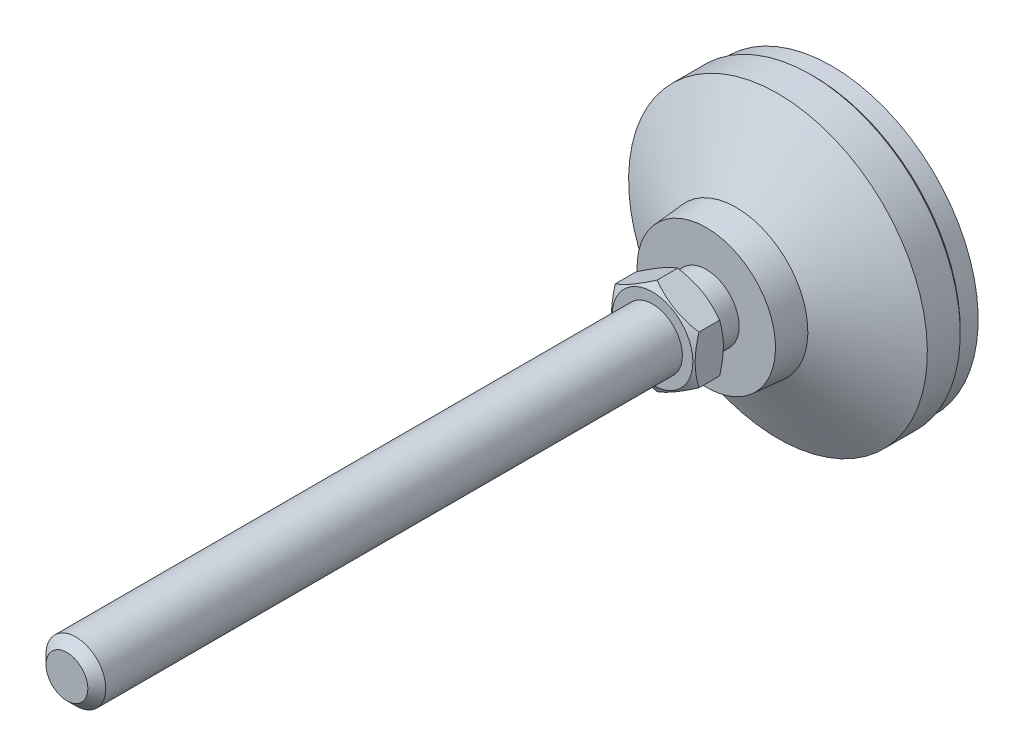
ISO-10303-21;
HEADER;
FILE_DESCRIPTION(('STEP AP214'),'2;1');
FILE_NAME('part.step','',(''),(''),'','','');
FILE_SCHEMA(('AUTOMOTIVE_DESIGN { 1 0 10303 214 1 1 1 1 }'));
ENDSEC;
DATA;
#1=APPLICATION_CONTEXT('core data for automotive mechanical design processes');
#2=APPLICATION_PROTOCOL_DEFINITION('international standard','automotive_design',2000,#1);
#3=PRODUCT_CONTEXT('',#1,'mechanical');
#4=PRODUCT('Part','Part','',(#3));
#5=PRODUCT_RELATED_PRODUCT_CATEGORY('part','',(#4));
#6=PRODUCT_DEFINITION_FORMATION('','',#4);
#7=PRODUCT_DEFINITION_CONTEXT('part definition',#1,'design');
#8=PRODUCT_DEFINITION('design','',#6,#7);
#9=PRODUCT_DEFINITION_SHAPE('','',#8);
#10=(LENGTH_UNIT() NAMED_UNIT(*) SI_UNIT(.MILLI.,.METRE.));
#11=(NAMED_UNIT(*) PLANE_ANGLE_UNIT() SI_UNIT($,.RADIAN.));
#12=(NAMED_UNIT(*) SI_UNIT($,.STERADIAN.) SOLID_ANGLE_UNIT());
#13=UNCERTAINTY_MEASURE_WITH_UNIT(LENGTH_MEASURE(1.E-05),#10,'distance_accuracy_value','');
#14=(GEOMETRIC_REPRESENTATION_CONTEXT(3) GLOBAL_UNCERTAINTY_ASSIGNED_CONTEXT((#13)) GLOBAL_UNIT_ASSIGNED_CONTEXT((#10,
#11,#12)) REPRESENTATION_CONTEXT('',''));
#15=CARTESIAN_POINT('',(0.,0.,0.));
#16=DIRECTION('',(0.,0.,1.));
#17=DIRECTION('',(1.,0.,0.));
#18=AXIS2_PLACEMENT_3D('',#15,#16,#17);
#19=CARTESIAN_POINT('',(0.,0.,2.));
#20=DIRECTION('',(0.,0.,-1.));
#21=DIRECTION('',(0.,1.,0.));
#22=AXIS2_PLACEMENT_3D('',#19,#20,#21);
#23=CYLINDRICAL_SURFACE('',#22,5.50000000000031);
#24=CARTESIAN_POINT('',(0.,0.,25.));
#25=DIRECTION('',(0.,0.,-1.));
#26=DIRECTION('',(0.,1.,0.));
#27=AXIS2_PLACEMENT_3D('',#24,#25,#26);
#28=CIRCLE('',#27,5.50000000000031);
#29=CARTESIAN_POINT('',(0.,5.50000000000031,25.));
#30=VERTEX_POINT('',#29);
#31=EDGE_CURVE('E100',#30,#30,#28,.T.);
#32=ORIENTED_EDGE('',*,*,#31,.T.);
#33=EDGE_LOOP('',(#32));
#34=FACE_BOUND('',#33,.T.);
#35=CARTESIAN_POINT('',(0.,0.,21.));
#36=DIRECTION('',(0.,0.,-1.));
#37=DIRECTION('',(0.,1.,0.));
#38=AXIS2_PLACEMENT_3D('',#35,#36,#37);
#39=CIRCLE('',#38,5.50000000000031);
#40=CARTESIAN_POINT('',(0.,5.50000000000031,21.));
#41=VERTEX_POINT('',#40);
#42=EDGE_CURVE('E93',#41,#41,#39,.T.);
#43=ORIENTED_EDGE('',*,*,#42,.F.);
#44=EDGE_LOOP('',(#43));
#45=FACE_BOUND('',#44,.T.);
#46=ADVANCED_FACE('F14',(#34,#45),#23,.T.);
#47=CARTESIAN_POINT('',(-5.50000000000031,0.,25.));
#48=DIRECTION('',(0.,0.,1.));
#49=DIRECTION('',(0.,-1.,0.));
#50=AXIS2_PLACEMENT_3D('',#47,#48,#49);
#51=PLANE('',#50);
#52=CARTESIAN_POINT('',(0.,0.,25.));
#53=DIRECTION('',(0.,0.,1.));
#54=DIRECTION('',(0.,-1.,0.));
#55=AXIS2_PLACEMENT_3D('',#52,#53,#54);
#56=CIRCLE('',#55,6.75);
#57=CARTESIAN_POINT('',(0.,-6.75,25.));
#58=VERTEX_POINT('',#57);
#59=EDGE_CURVE('E284',#58,#58,#56,.T.);
#60=ORIENTED_EDGE('',*,*,#59,.F.);
#61=EDGE_LOOP('',(#60));
#62=FACE_BOUND('',#61,.T.);
#63=ORIENTED_EDGE('',*,*,#31,.F.);
#64=EDGE_LOOP('',(#63));
#65=FACE_BOUND('',#64,.T.);
#66=ADVANCED_FACE('F142',(#62,#65),#51,.F.);
#67=CARTESIAN_POINT('',(0.,5.50000000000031,21.));
#68=DIRECTION('',(0.,0.,-1.));
#69=DIRECTION('',(0.,1.,0.));
#70=AXIS2_PLACEMENT_3D('',#67,#68,#69);
#71=PLANE('',#70);
#72=ORIENTED_EDGE('',*,*,#42,.T.);
#73=EDGE_LOOP('',(#72));
#74=FACE_BOUND('',#73,.T.);
#75=CARTESIAN_POINT('',(0.,0.,21.));
#76=DIRECTION('',(0.,0.,-1.));
#77=DIRECTION('',(0.,1.,0.));
#78=AXIS2_PLACEMENT_3D('',#75,#76,#77);
#79=CIRCLE('',#78,11.5833333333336);
#80=CARTESIAN_POINT('',(0.,11.5833333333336,21.));
#81=VERTEX_POINT('',#80);
#82=EDGE_CURVE('E88',#81,#81,#79,.T.);
#83=ORIENTED_EDGE('',*,*,#82,.F.);
#84=EDGE_LOOP('',(#83));
#85=FACE_BOUND('',#84,.T.);
#86=ADVANCED_FACE('F125',(#74,#85),#71,.F.);
#87=CARTESIAN_POINT('',(0.,0.,2.));
#88=DIRECTION('',(0.,0.,-1.));
#89=DIRECTION('',(0.,1.,0.));
#90=AXIS2_PLACEMENT_3D('',#87,#88,#89);
#91=CYLINDRICAL_SURFACE('',#90,25.);
#92=CARTESIAN_POINT('',(0.,0.,3.5));
#93=DIRECTION('',(0.,0.,1.));
#94=DIRECTION('',(0.,-1.,0.));
#95=AXIS2_PLACEMENT_3D('',#92,#93,#94);
#96=CIRCLE('',#95,25.);
#97=CARTESIAN_POINT('',(0.,-25.,3.5));
#98=VERTEX_POINT('',#97);
#99=EDGE_CURVE('E108',#98,#98,#96,.T.);
#100=ORIENTED_EDGE('',*,*,#99,.T.);
#101=EDGE_LOOP('',(#100));
#102=FACE_BOUND('',#101,.T.);
#103=CARTESIAN_POINT('',(0.,0.,9.));
#104=DIRECTION('',(0.,0.,-1.));
#105=DIRECTION('',(0.,1.,0.));
#106=AXIS2_PLACEMENT_3D('',#103,#104,#105);
#107=CIRCLE('',#106,25.);
#108=CARTESIAN_POINT('',(0.,25.,9.));
#109=VERTEX_POINT('',#108);
#110=EDGE_CURVE('E106',#109,#109,#107,.T.);
#111=ORIENTED_EDGE('',*,*,#110,.T.);
#112=EDGE_LOOP('',(#111));
#113=FACE_BOUND('',#112,.T.);
#114=ADVANCED_FACE('F121',(#102,#113),#91,.T.);
#115=CARTESIAN_POINT('',(0.,0.,16.));
#116=DIRECTION('',(0.,0.,-1.));
#117=DIRECTION('',(0.,1.,0.));
#118=AXIS2_PLACEMENT_3D('',#115,#116,#117);
#119=CONICAL_SURFACE('',#118,12.0000000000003,1.07685495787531);
#120=ORIENTED_EDGE('',*,*,#110,.F.);
#121=EDGE_LOOP('',(#120));
#122=FACE_BOUND('',#121,.T.);
#123=CARTESIAN_POINT('',(0.,0.,16.));
#124=DIRECTION('',(0.,0.,-1.));
#125=DIRECTION('',(0.,1.,0.));
#126=AXIS2_PLACEMENT_3D('',#123,#124,#125);
#127=CIRCLE('',#126,12.0000000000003);
#128=CARTESIAN_POINT('',(0.,12.0000000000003,16.));
#129=VERTEX_POINT('',#128);
#130=EDGE_CURVE('E103',#129,#129,#127,.T.);
#131=ORIENTED_EDGE('',*,*,#130,.T.);
#132=EDGE_LOOP('',(#131));
#133=FACE_BOUND('',#132,.T.);
#134=ADVANCED_FACE('F124',(#122,#133),#119,.T.);
#135=CARTESIAN_POINT('',(0.,0.,22.));
#136=DIRECTION('',(0.,0.,-1.));
#137=DIRECTION('',(0.,1.,0.));
#138=AXIS2_PLACEMENT_3D('',#135,#136,#137);
#139=CONICAL_SURFACE('',#138,11.5000000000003,0.0831412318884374);
#140=ORIENTED_EDGE('',*,*,#82,.T.);
#141=EDGE_LOOP('',(#140));
#142=FACE_BOUND('',#141,.T.);
#143=ORIENTED_EDGE('',*,*,#130,.F.);
#144=EDGE_LOOP('',(#143));
#145=FACE_BOUND('',#144,.T.);
#146=ADVANCED_FACE('F118',(#142,#145),#139,.T.);
#147=CARTESIAN_POINT('',(0.,0.,3.5));
#148=DIRECTION('',(0.,0.,1.));
#149=DIRECTION('',(0.,-1.,0.));
#150=AXIS2_PLACEMENT_3D('',#147,#148,#149);
#151=CONICAL_SURFACE('',#150,25.,0.785398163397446);
#152=CARTESIAN_POINT('',(0.,0.,3.));
#153=DIRECTION('',(0.,0.,1.));
#154=DIRECTION('',(0.,-1.,0.));
#155=AXIS2_PLACEMENT_3D('',#152,#153,#154);
#156=CIRCLE('',#155,24.5);
#157=CARTESIAN_POINT('',(0.,-24.5,3.));
#158=VERTEX_POINT('',#157);
#159=EDGE_CURVE('E28',#158,#158,#156,.F.);
#160=ORIENTED_EDGE('',*,*,#159,.F.);
#161=EDGE_LOOP('',(#160));
#162=FACE_BOUND('',#161,.T.);
#163=ORIENTED_EDGE('',*,*,#99,.F.);
#164=EDGE_LOOP('',(#163));
#165=FACE_BOUND('',#164,.T.);
#166=ADVANCED_FACE('F16',(#162,#165),#151,.T.);
#167=CARTESIAN_POINT('',(0.,0.,0.));
#168=DIRECTION('',(0.,0.,1.));
#169=DIRECTION('',(0.,-1.,0.));
#170=AXIS2_PLACEMENT_3D('',#167,#168,#169);
#171=CYLINDRICAL_SURFACE('',#170,24.5);
#172=CARTESIAN_POINT('',(0.,0.,0.));
#173=DIRECTION('',(0.,0.,-1.));
#174=DIRECTION('',(0.,1.,0.));
#175=AXIS2_PLACEMENT_3D('',#172,#173,#174);
#176=CIRCLE('',#175,24.5);
#177=CARTESIAN_POINT('',(0.,24.5,0.));
#178=VERTEX_POINT('',#177);
#179=EDGE_CURVE('E251',#178,#178,#176,.T.);
#180=ORIENTED_EDGE('',*,*,#179,.F.);
#181=EDGE_LOOP('',(#180));
#182=FACE_BOUND('',#181,.T.);
#183=ORIENTED_EDGE('',*,*,#159,.T.);
#184=EDGE_LOOP('',(#183));
#185=FACE_BOUND('',#184,.T.);
#186=ADVANCED_FACE('F114',(#182,#185),#171,.T.);
#187=CARTESIAN_POINT('',(0.,0.,0.));
#188=DIRECTION('',(0.,0.,-1.));
#189=DIRECTION('',(0.,1.,0.));
#190=AXIS2_PLACEMENT_3D('',#187,#188,#189);
#191=PLANE('',#190);
#192=ORIENTED_EDGE('',*,*,#179,.T.);
#193=EDGE_LOOP('',(#192));
#194=FACE_BOUND('',#193,.T.);
#195=ADVANCED_FACE('F193',(#194),#191,.T.);
#196=CARTESIAN_POINT('',(0.,0.,25.));
#197=DIRECTION('',(0.,0.,1.));
#198=DIRECTION('',(0.,-1.,0.));
#199=AXIS2_PLACEMENT_3D('',#196,#197,#198);
#200=CONICAL_SURFACE('',#199,6.75,1.0471975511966);
#201=CARTESIAN_POINT('',(0.000200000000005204,-8.08301923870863,25.7696190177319));
#202=CARTESIAN_POINT('',(-0.153667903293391,-7.99418356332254,25.7183374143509));
#203=CARTESIAN_POINT('',(-0.308109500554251,-7.90501666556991,25.669383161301));
#204=CARTESIAN_POINT('',(-0.618246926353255,-7.72595873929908,25.5767703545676));
#205=CARTESIAN_POINT('',(-0.773943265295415,-7.63606741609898,25.5331140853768));
#206=CARTESIAN_POINT('',(-1.24352516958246,-7.36495417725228,25.4109491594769));
#207=CARTESIAN_POINT('',(-1.5592643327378,-7.18266208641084,25.3414631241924));
#208=CARTESIAN_POINT('',(-2.03176224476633,-6.90986528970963,25.2599825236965));
#209=CARTESIAN_POINT('',(-2.18710922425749,-6.82017566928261,25.2367710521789));
#210=CARTESIAN_POINT('',(-2.49850511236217,-6.64039116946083,25.1978487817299));
#211=CARTESIAN_POINT('',(-2.65455395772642,-6.55029632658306,25.1821373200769));
#212=CARTESIAN_POINT('',(-2.96692267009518,-6.36995016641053,25.1586154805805));
#213=CARTESIAN_POINT('',(-3.12324202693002,-6.27969914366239,25.1507961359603));
#214=CARTESIAN_POINT('',(-3.43601650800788,-6.09911871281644,25.1432178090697));
#215=CARTESIAN_POINT('',(-3.59247162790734,-6.00878930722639,25.1434585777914));
#216=CARTESIAN_POINT('',(-4.02110687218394,-5.76131663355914,25.155197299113));
#217=CARTESIAN_POINT('',(-4.2931466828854,-5.60425437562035,25.1749033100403));
#218=CARTESIAN_POINT('',(-4.8354194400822,-5.29117305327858,25.2373910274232));
#219=CARTESIAN_POINT('',(-5.10565047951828,-5.13515508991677,25.2801940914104));
#220=CARTESIAN_POINT('',(-5.64901454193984,-4.82144370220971,25.3871892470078));
#221=CARTESIAN_POINT('',(-5.92207900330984,-4.66378986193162,25.4518346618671));
#222=CARTESIAN_POINT('',(-6.46413578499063,-4.35083323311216,25.5985536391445));
#223=CARTESIAN_POINT('',(-6.73313504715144,-4.1955264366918,25.680592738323));
#224=CARTESIAN_POINT('',(-7.0002,-4.04133641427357,25.7696190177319));
#225=B_SPLINE_CURVE_WITH_KNOTS('',3,(#201,#202,#203,#204,#205,#206,#207,#208,#209,#210,#211,
#212,#213,#214,#215,#216,#217,#218,#219,#220,#221,#222,#223,#224),.UNSPECIFIED.,.F.,.F.,(4,2,2,
2,2,2,2,2,2,2,2,4),(0.,0.554727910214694,1.10969417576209,2.2219327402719,2.76443041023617,
3.30688013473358,3.84871284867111,4.3905288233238,5.33376515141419,6.27787517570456,
7.2429241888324,8.20607866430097),.UNSPECIFIED.);
#226=CARTESIAN_POINT('',(0.,-8.08290376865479,25.7695523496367));
#227=VERTEX_POINT('',#226);
#228=CARTESIAN_POINT('',(-7.,-4.04145188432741,25.7695523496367));
#229=VERTEX_POINT('',#228);
#230=EDGE_CURVE('E73',#227,#229,#225,.T.);
#231=ORIENTED_EDGE('',*,*,#230,.T.);
#232=CARTESIAN_POINT('',(-7.,10.881878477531,28.5731663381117));
#233=CARTESIAN_POINT('',(-7.,10.5759223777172,28.4246456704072));
#234=CARTESIAN_POINT('',(-7.,10.2692667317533,28.2775415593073));
#235=CARTESIAN_POINT('',(-7.,9.65418441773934,27.9869626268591));
#236=CARTESIAN_POINT('',(-7.,9.34575748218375,27.8434883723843));
#237=CARTESIAN_POINT('',(-7.,8.72518404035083,27.5602490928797));
#238=CARTESIAN_POINT('',(-7.,8.41302644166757,27.4205082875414));
#239=CARTESIAN_POINT('',(-7.,7.78623760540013,27.1467106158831));
#240=CARTESIAN_POINT('',(-7.,7.47160648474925,27.0126534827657));
#241=CARTESIAN_POINT('',(-7.,6.82911545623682,26.7474907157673));
#242=CARTESIAN_POINT('',(-7.,6.50115736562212,26.6166216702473));
#243=CARTESIAN_POINT('',(-7.,5.84141472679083,26.3647252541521));
#244=CARTESIAN_POINT('',(-7.,5.50962975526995,26.2436989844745));
#245=CARTESIAN_POINT('',(-7.,4.84231409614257,26.0146465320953));
#246=CARTESIAN_POINT('',(-7.,4.50679246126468,25.9065942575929));
#247=CARTESIAN_POINT('',(-7.,3.83094824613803,25.7069384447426));
#248=CARTESIAN_POINT('',(-7.,3.4906272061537,25.6153297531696));
#249=CARTESIAN_POINT('',(-7.,2.8068282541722,25.4534347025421));
#250=CARTESIAN_POINT('',(-7.,2.46337870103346,25.3830317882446));
#251=CARTESIAN_POINT('',(-7.,1.94505562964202,25.296366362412));
#252=CARTESIAN_POINT('',(-7.,1.77174375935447,25.270633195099));
#253=CARTESIAN_POINT('',(-7.,1.4242505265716,25.2259841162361));
#254=CARTESIAN_POINT('',(-7.,1.25006925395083,25.2070675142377));
#255=CARTESIAN_POINT('',(-7.,0.903356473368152,25.176666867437));
#256=CARTESIAN_POINT('',(-7.,0.730833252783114,25.165088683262));
#257=CARTESIAN_POINT('',(-7.,0.385451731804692,25.149239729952));
#258=CARTESIAN_POINT('',(-7.,0.212593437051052,25.1449688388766));
#259=CARTESIAN_POINT('',(-7.,-0.133149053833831,25.1438364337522));
#260=CARTESIAN_POINT('',(-7.,-0.306033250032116,25.1469749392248));
#261=CARTESIAN_POINT('',(-7.,-0.651514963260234,25.1605842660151));
#262=CARTESIAN_POINT('',(-7.,-0.824112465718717,25.1710554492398));
#263=CARTESIAN_POINT('',(-7.,-1.23812388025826,25.2047451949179));
#264=CARTESIAN_POINT('',(-7.,-1.47926423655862,25.2313988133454));
#265=CARTESIAN_POINT('',(-7.,-1.95976100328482,25.2975709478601));
#266=CARTESIAN_POINT('',(-7.,-2.1991171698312,25.3370911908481));
#267=CARTESIAN_POINT('',(-7.,-2.91423225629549,25.4728568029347));
#268=CARTESIAN_POINT('',(-7.,-3.38677291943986,25.586282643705));
#269=CARTESIAN_POINT('',(-7.,-4.09338777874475,25.7830543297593));
#270=CARTESIAN_POINT('',(-7.,-4.33112485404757,25.8540038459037));
#271=CARTESIAN_POINT('',(-7.,-4.80429012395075,26.0032925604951));
#272=CARTESIAN_POINT('',(-7.,-5.0397183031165,26.0816318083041));
#273=CARTESIAN_POINT('',(-7.,-5.50833948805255,26.244441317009));
#274=CARTESIAN_POINT('',(-7.,-5.74153319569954,26.3289095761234));
#275=CARTESIAN_POINT('',(-7.,-6.20598704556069,26.5029811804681));
#276=CARTESIAN_POINT('',(-7.,-6.43724721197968,26.5925844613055));
#277=CARTESIAN_POINT('',(-7.,-6.98916133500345,26.8123542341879));
#278=CARTESIAN_POINT('',(-7.,-7.30900559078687,26.9445505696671));
#279=CARTESIAN_POINT('',(-7.,-7.94592265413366,27.2154785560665));
#280=CARTESIAN_POINT('',(-7.,-8.26299528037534,27.354210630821));
#281=CARTESIAN_POINT('',(-7.,-8.89488830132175,27.6368774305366));
#282=CARTESIAN_POINT('',(-7.,-9.20970819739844,27.7808132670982));
#283=CARTESIAN_POINT('',(-7.,-9.83742326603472,28.0728299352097));
#284=CARTESIAN_POINT('',(-7.,-10.150318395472,28.2209108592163));
#285=CARTESIAN_POINT('',(-7.,-10.7748456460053,28.5205922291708));
#286=CARTESIAN_POINT('',(-7.,-11.0864759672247,28.6721964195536));
#287=CARTESIAN_POINT('',(-7.,-11.7083826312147,28.9781595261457));
#288=CARTESIAN_POINT('',(-7.,-12.0186589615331,29.1325184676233));
#289=CARTESIAN_POINT('',(-7.,-12.9476977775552,29.5989412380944));
#290=CARTESIAN_POINT('',(-7.,-13.5647586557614,29.9143938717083));
#291=CARTESIAN_POINT('',(-7.,-14.7428047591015,30.5242920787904));
#292=CARTESIAN_POINT('',(-7.,-15.3040599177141,30.8182186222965));
#293=CARTESIAN_POINT('',(-7.,-16.4244943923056,31.4100497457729));
#294=CARTESIAN_POINT('',(-7.,-16.9836736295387,31.7079544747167));
#295=CARTESIAN_POINT('',(-7.,-18.0989732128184,32.3060119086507));
#296=CARTESIAN_POINT('',(-7.,-18.6550977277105,32.606156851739));
#297=CARTESIAN_POINT('',(-7.,-19.7660233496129,33.2088114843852));
#298=CARTESIAN_POINT('',(-7.,-20.3208245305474,33.5113210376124));
#299=CARTESIAN_POINT('',(-7.,-20.8751406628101,33.8147108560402));
#300=B_SPLINE_CURVE_WITH_KNOTS('',3,(#232,#233,#234,#235,#236,#237,#238,#239,#240,#241,#242,
#243,#244,#245,#246,#247,#248,#249,#250,#251,#252,#253,#254,#255,#256,#257,#258,#259,#260,#261,
#262,#263,#264,#265,#266,#267,#268,#269,#270,#271,#272,#273,#274,#275,#276,#277,#278,#279,#280,
#281,#282,#283,#284,#285,#286,#287,#288,#289,#290,#291,#292,#293,#294,#295,#296,#297,#298,#299),
.UNSPECIFIED.,.F.,.F.,(4,2,2,2,2,2,2,2,2,2,2,2,2,2,2,2,2,2,2,2,2,2,2,2,2,2,2,2,2,2,2,2,2,4),(0.,
1.02031018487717,2.04077873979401,3.06675901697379,4.09269108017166,5.15188378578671,
6.21119479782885,7.26833843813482,8.32515020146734,9.3760426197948,9.90156529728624,
10.4270347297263,10.9456190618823,11.4641947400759,11.9827717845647,12.5013744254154,
13.2287906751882,13.9563045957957,15.4121267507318,16.1563590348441,16.9005962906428,
17.6445915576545,18.3885774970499,19.4267396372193,20.4649691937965,21.5034218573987,
22.5418977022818,23.5815328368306,24.6211775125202,26.7001717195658,28.6008392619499,
30.5015781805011,32.3974236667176,34.2931606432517),.UNSPECIFIED.);
#301=CARTESIAN_POINT('',(-7.,4.04145188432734,25.7695523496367));
#302=VERTEX_POINT('',#301);
#303=EDGE_CURVE('E81',#229,#302,#300,.F.);
#304=ORIENTED_EDGE('',*,*,#303,.T.);
#305=CARTESIAN_POINT('',(-7.0002,4.0413364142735,25.7696190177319));
#306=CARTESIAN_POINT('',(-6.84633209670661,4.13017208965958,25.7183374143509));
#307=CARTESIAN_POINT('',(-6.69189049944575,4.21933898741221,25.669383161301));
#308=CARTESIAN_POINT('',(-6.38175307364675,4.39839691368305,25.5767703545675));
#309=CARTESIAN_POINT('',(-6.22605673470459,4.48828823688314,25.5331140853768));
#310=CARTESIAN_POINT('',(-5.75647483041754,4.75940147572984,25.4109491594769));
#311=CARTESIAN_POINT('',(-5.44073566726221,4.94169356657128,25.3414631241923));
#312=CARTESIAN_POINT('',(-4.96823775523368,5.21449036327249,25.2599825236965));
#313=CARTESIAN_POINT('',(-4.81289077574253,5.3041799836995,25.2367710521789));
#314=CARTESIAN_POINT('',(-4.50149488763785,5.48396448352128,25.1978487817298));
#315=CARTESIAN_POINT('',(-4.34544604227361,5.57405932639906,25.1821373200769));
#316=CARTESIAN_POINT('',(-4.03307732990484,5.75440548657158,25.1586154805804));
#317=CARTESIAN_POINT('',(-3.87675797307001,5.84465650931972,25.1507961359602));
#318=CARTESIAN_POINT('',(-3.56398349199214,6.02523694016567,25.1432178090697));
#319=CARTESIAN_POINT('',(-3.40752837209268,6.11556634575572,25.1434585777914));
#320=CARTESIAN_POINT('',(-2.97889312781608,6.36303901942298,25.155197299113));
#321=CARTESIAN_POINT('',(-2.70685331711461,6.52010127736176,25.1749033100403));
#322=CARTESIAN_POINT('',(-2.16458055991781,6.83318259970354,25.2373910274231));
#323=CARTESIAN_POINT('',(-1.89434952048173,6.98920056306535,25.2801940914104));
#324=CARTESIAN_POINT('',(-1.35098545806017,7.30291195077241,25.3871892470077));
#325=CARTESIAN_POINT('',(-1.07792099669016,7.4605657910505,25.4518346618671));
#326=CARTESIAN_POINT('',(-0.535864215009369,7.77352241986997,25.5985536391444));
#327=CARTESIAN_POINT('',(-0.266864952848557,7.92882921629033,25.680592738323));
#328=CARTESIAN_POINT('',(0.000200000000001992,8.08301923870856,25.7696190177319));
#329=B_SPLINE_CURVE_WITH_KNOTS('',3,(#305,#306,#307,#308,#309,#310,#311,#312,#313,#314,#315,
#316,#317,#318,#319,#320,#321,#322,#323,#324,#325,#326,#327,#328),.UNSPECIFIED.,.F.,.F.,(4,2,2,
2,2,2,2,2,2,2,2,4),(0.,0.554727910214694,1.10969417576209,2.22193274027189,2.76443041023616,
3.30688013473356,3.84871284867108,4.39052882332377,5.33376515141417,6.27787517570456,
7.2429241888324,8.20607866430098),.UNSPECIFIED.);
#330=CARTESIAN_POINT('',(0.,8.08290376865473,25.7695523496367));
#331=VERTEX_POINT('',#330);
#332=EDGE_CURVE('E214',#302,#331,#329,.T.);
#333=ORIENTED_EDGE('',*,*,#332,.T.);
#334=CARTESIAN_POINT('',(-0.000199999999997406,8.08301923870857,25.7696190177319));
#335=CARTESIAN_POINT('',(0.153667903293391,7.99418356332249,25.7183374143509));
#336=CARTESIAN_POINT('',(0.308109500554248,7.90501666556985,25.669383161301));
#337=CARTESIAN_POINT('',(0.61824692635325,7.72595873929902,25.5767703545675));
#338=CARTESIAN_POINT('',(0.77394326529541,7.63606741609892,25.5331140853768));
#339=CARTESIAN_POINT('',(1.24352516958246,7.36495417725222,25.4109491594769));
#340=CARTESIAN_POINT('',(1.55926433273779,7.18266208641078,25.3414631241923));
#341=CARTESIAN_POINT('',(2.03176224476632,6.90986528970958,25.2599825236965));
#342=CARTESIAN_POINT('',(2.18710922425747,6.82017566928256,25.2367710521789));
#343=CARTESIAN_POINT('',(2.49850511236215,6.64039116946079,25.1978487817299));
#344=CARTESIAN_POINT('',(2.65455395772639,6.55029632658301,25.1821373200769));
#345=CARTESIAN_POINT('',(2.96692267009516,6.36995016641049,25.1586154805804));
#346=CARTESIAN_POINT('',(3.12324202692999,6.27969914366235,25.1507961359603));
#347=CARTESIAN_POINT('',(3.43601650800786,6.0991187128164,25.1432178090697));
#348=CARTESIAN_POINT('',(3.59247162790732,6.00878930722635,25.1434585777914));
#349=CARTESIAN_POINT('',(4.02110687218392,5.76131663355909,25.155197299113));
#350=CARTESIAN_POINT('',(4.29314668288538,5.60425437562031,25.1749033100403));
#351=CARTESIAN_POINT('',(4.83541944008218,5.29117305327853,25.2373910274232));
#352=CARTESIAN_POINT('',(5.10565047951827,5.13515508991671,25.2801940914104));
#353=CARTESIAN_POINT('',(5.64901454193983,4.82144370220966,25.3871892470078));
#354=CARTESIAN_POINT('',(5.92207900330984,4.66378986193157,25.4518346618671));
#355=CARTESIAN_POINT('',(6.46413578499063,4.3508332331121,25.5985536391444));
#356=CARTESIAN_POINT('',(6.73313504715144,4.19552643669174,25.680592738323));
#357=CARTESIAN_POINT('',(7.0002,4.04133641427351,25.7696190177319));
#358=B_SPLINE_CURVE_WITH_KNOTS('',3,(#334,#335,#336,#337,#338,#339,#340,#341,#342,#343,#344,
#345,#346,#347,#348,#349,#350,#351,#352,#353,#354,#355,#356,#357),.UNSPECIFIED.,.F.,.F.,(4,2,2,
2,2,2,2,2,2,2,2,4),(0.,0.554727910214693,1.10969417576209,2.22193274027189,2.76443041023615,
3.30688013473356,3.84871284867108,4.39052882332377,5.33376515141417,6.27787517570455,
7.2429241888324,8.20607866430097),.UNSPECIFIED.);
#359=CARTESIAN_POINT('',(7.,4.04145188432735,25.7695523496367));
#360=VERTEX_POINT('',#359);
#361=EDGE_CURVE('E208',#331,#360,#358,.T.);
#362=ORIENTED_EDGE('',*,*,#361,.T.);
#363=CARTESIAN_POINT('',(7.,10.881878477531,28.5731663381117));
#364=CARTESIAN_POINT('',(7.,10.5759223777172,28.4246456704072));
#365=CARTESIAN_POINT('',(7.,10.2692667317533,28.2775415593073));
#366=CARTESIAN_POINT('',(7.,9.65418441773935,27.9869626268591));
#367=CARTESIAN_POINT('',(7.,9.34575748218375,27.8434883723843));
#368=CARTESIAN_POINT('',(7.,8.72518404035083,27.5602490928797));
#369=CARTESIAN_POINT('',(7.,8.41302644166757,27.4205082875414));
#370=CARTESIAN_POINT('',(7.,7.78623760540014,27.1467106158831));
#371=CARTESIAN_POINT('',(7.,7.47160648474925,27.0126534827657));
#372=CARTESIAN_POINT('',(7.,6.82911545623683,26.7474907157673));
#373=CARTESIAN_POINT('',(7.,6.50115736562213,26.6166216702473));
#374=CARTESIAN_POINT('',(7.,5.84141472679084,26.3647252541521));
#375=CARTESIAN_POINT('',(7.,5.50962975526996,26.2436989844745));
#376=CARTESIAN_POINT('',(7.,4.84231409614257,26.0146465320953));
#377=CARTESIAN_POINT('',(7.,4.50679246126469,25.9065942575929));
#378=CARTESIAN_POINT('',(7.,3.83094824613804,25.7069384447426));
#379=CARTESIAN_POINT('',(7.,3.49062720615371,25.6153297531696));
#380=CARTESIAN_POINT('',(7.,2.80682825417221,25.4534347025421));
#381=CARTESIAN_POINT('',(7.,2.46337870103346,25.3830317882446));
#382=CARTESIAN_POINT('',(7.,1.94505562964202,25.296366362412));
#383=CARTESIAN_POINT('',(7.,1.77174375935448,25.270633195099));
#384=CARTESIAN_POINT('',(7.,1.4242505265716,25.2259841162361));
#385=CARTESIAN_POINT('',(7.,1.25006925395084,25.2070675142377));
#386=CARTESIAN_POINT('',(7.,0.903356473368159,25.176666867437));
#387=CARTESIAN_POINT('',(7.,0.730833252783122,25.165088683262));
#388=CARTESIAN_POINT('',(7.,0.3854517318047,25.149239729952));
#389=CARTESIAN_POINT('',(7.,0.21259343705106,25.1449688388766));
#390=CARTESIAN_POINT('',(7.,-0.133149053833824,25.1438364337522));
#391=CARTESIAN_POINT('',(7.,-0.30603325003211,25.1469749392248));
#392=CARTESIAN_POINT('',(7.,-0.651514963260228,25.1605842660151));
#393=CARTESIAN_POINT('',(7.,-0.824112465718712,25.1710554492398));
#394=CARTESIAN_POINT('',(7.,-1.23812388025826,25.2047451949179));
#395=CARTESIAN_POINT('',(7.,-1.47926423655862,25.2313988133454));
#396=CARTESIAN_POINT('',(7.,-1.95976100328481,25.2975709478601));
#397=CARTESIAN_POINT('',(7.,-2.19911716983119,25.3370911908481));
#398=CARTESIAN_POINT('',(7.,-2.91423225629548,25.4728568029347));
#399=CARTESIAN_POINT('',(7.,-3.38677291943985,25.586282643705));
#400=CARTESIAN_POINT('',(7.,-4.09338777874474,25.7830543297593));
#401=CARTESIAN_POINT('',(7.,-4.33112485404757,25.8540038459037));
#402=CARTESIAN_POINT('',(7.,-4.80429012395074,26.0032925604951));
#403=CARTESIAN_POINT('',(7.,-5.03971830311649,26.0816318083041));
#404=CARTESIAN_POINT('',(7.,-5.50833948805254,26.244441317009));
#405=CARTESIAN_POINT('',(7.,-5.74153319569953,26.3289095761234));
#406=CARTESIAN_POINT('',(7.,-6.20598704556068,26.5029811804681));
#407=CARTESIAN_POINT('',(7.,-6.43724721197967,26.5925844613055));
#408=CARTESIAN_POINT('',(7.,-6.98916133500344,26.8123542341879));
#409=CARTESIAN_POINT('',(7.,-7.30900559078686,26.9445505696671));
#410=CARTESIAN_POINT('',(7.,-7.94592265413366,27.2154785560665));
#411=CARTESIAN_POINT('',(7.,-8.26299528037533,27.354210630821));
#412=CARTESIAN_POINT('',(7.,-8.89488830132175,27.6368774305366));
#413=CARTESIAN_POINT('',(7.,-9.20970819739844,27.7808132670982));
#414=CARTESIAN_POINT('',(7.,-9.83742326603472,28.0728299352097));
#415=CARTESIAN_POINT('',(7.,-10.150318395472,28.2209108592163));
#416=CARTESIAN_POINT('',(7.,-10.7748456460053,28.5205922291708));
#417=CARTESIAN_POINT('',(7.,-11.0864759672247,28.6721964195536));
#418=CARTESIAN_POINT('',(7.,-11.7083826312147,28.9781595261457));
#419=CARTESIAN_POINT('',(7.,-12.0186589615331,29.1325184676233));
#420=CARTESIAN_POINT('',(7.,-12.9476977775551,29.5989412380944));
#421=CARTESIAN_POINT('',(7.,-13.5647586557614,29.9143938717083));
#422=CARTESIAN_POINT('',(7.,-14.7428047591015,30.5242920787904));
#423=CARTESIAN_POINT('',(7.,-15.3040599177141,30.8182186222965));
#424=CARTESIAN_POINT('',(7.,-16.4244943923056,31.4100497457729));
#425=CARTESIAN_POINT('',(7.,-16.9836736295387,31.7079544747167));
#426=CARTESIAN_POINT('',(7.,-18.0989732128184,32.3060119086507));
#427=CARTESIAN_POINT('',(7.,-18.6550977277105,32.606156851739));
#428=CARTESIAN_POINT('',(7.,-19.7660233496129,33.2088114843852));
#429=CARTESIAN_POINT('',(7.,-20.3208245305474,33.5113210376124));
#430=CARTESIAN_POINT('',(7.,-20.8751406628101,33.8147108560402));
#431=B_SPLINE_CURVE_WITH_KNOTS('',3,(#363,#364,#365,#366,#367,#368,#369,#370,#371,#372,#373,
#374,#375,#376,#377,#378,#379,#380,#381,#382,#383,#384,#385,#386,#387,#388,#389,#390,#391,#392,
#393,#394,#395,#396,#397,#398,#399,#400,#401,#402,#403,#404,#405,#406,#407,#408,#409,#410,#411,
#412,#413,#414,#415,#416,#417,#418,#419,#420,#421,#422,#423,#424,#425,#426,#427,#428,#429,#430),
.UNSPECIFIED.,.F.,.F.,(4,2,2,2,2,2,2,2,2,2,2,2,2,2,2,2,2,2,2,2,2,2,2,2,2,2,2,2,2,2,2,2,2,4),(0.,
1.02031018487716,2.04077873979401,3.06675901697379,4.09269108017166,5.1518837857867,
6.21119479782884,7.26833843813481,8.32515020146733,9.3760426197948,9.90156529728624,
10.4270347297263,10.9456190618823,11.4641947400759,11.9827717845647,12.5013744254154,
13.2287906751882,13.9563045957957,15.4121267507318,16.1563590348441,16.9005962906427,
17.6445915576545,18.3885774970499,19.4267396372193,20.4649691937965,21.5034218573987,
22.5418977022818,23.5815328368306,24.6211775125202,26.7001717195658,28.6008392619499,
30.5015781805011,32.3974236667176,34.2931606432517),.UNSPECIFIED.);
#432=CARTESIAN_POINT('',(7.,-4.04145188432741,25.7695523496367));
#433=VERTEX_POINT('',#432);
#434=EDGE_CURVE('E34',#360,#433,#431,.T.);
#435=ORIENTED_EDGE('',*,*,#434,.T.);
#436=CARTESIAN_POINT('',(7.0002,-4.04133641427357,25.7696190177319));
#437=CARTESIAN_POINT('',(6.84633209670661,-4.13017208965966,25.7183374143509));
#438=CARTESIAN_POINT('',(6.69189049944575,-4.21933898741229,25.669383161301));
#439=CARTESIAN_POINT('',(6.38175307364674,-4.39839691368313,25.5767703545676));
#440=CARTESIAN_POINT('',(6.22605673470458,-4.48828823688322,25.5331140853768));
#441=CARTESIAN_POINT('',(5.75647483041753,-4.75940147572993,25.4109491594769));
#442=CARTESIAN_POINT('',(5.4407356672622,-4.94169356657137,25.3414631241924));
#443=CARTESIAN_POINT('',(4.96823775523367,-5.21449036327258,25.2599825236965));
#444=CARTESIAN_POINT('',(4.81289077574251,-5.30417998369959,25.2367710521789));
#445=CARTESIAN_POINT('',(4.50149488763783,-5.48396448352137,25.1978487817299));
#446=CARTESIAN_POINT('',(4.34544604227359,-5.57405932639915,25.182137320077));
#447=CARTESIAN_POINT('',(4.03307732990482,-5.75440548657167,25.1586154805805));
#448=CARTESIAN_POINT('',(3.87675797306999,-5.84465650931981,25.1507961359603));
#449=CARTESIAN_POINT('',(3.56398349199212,-6.02523694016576,25.1432178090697));
#450=CARTESIAN_POINT('',(3.40752837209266,-6.11556634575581,25.1434585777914));
#451=CARTESIAN_POINT('',(2.97889312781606,-6.36303901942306,25.155197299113));
#452=CARTESIAN_POINT('',(2.7068533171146,-6.52010127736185,25.1749033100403));
#453=CARTESIAN_POINT('',(2.16458055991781,-6.83318259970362,25.2373910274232));
#454=CARTESIAN_POINT('',(1.89434952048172,-6.98920056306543,25.2801940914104));
#455=CARTESIAN_POINT('',(1.35098545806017,-7.30291195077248,25.3871892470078));
#456=CARTESIAN_POINT('',(1.07792099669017,-7.46056579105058,25.4518346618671));
#457=CARTESIAN_POINT('',(0.535864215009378,-7.77352241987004,25.5985536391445));
#458=CARTESIAN_POINT('',(0.266864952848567,-7.9288292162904,25.680592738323));
#459=CARTESIAN_POINT('',(-0.000199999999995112,-8.08301923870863,25.7696190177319));
#460=B_SPLINE_CURVE_WITH_KNOTS('',3,(#436,#437,#438,#439,#440,#441,#442,#443,#444,#445,#446,
#447,#448,#449,#450,#451,#452,#453,#454,#455,#456,#457,#458,#459),.UNSPECIFIED.,.F.,.F.,(4,2,2,
2,2,2,2,2,2,2,2,4),(0.,0.554727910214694,1.10969417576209,2.2219327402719,2.76443041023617,
3.30688013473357,3.8487128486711,4.39052882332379,5.33376515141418,6.27787517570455,
7.24292418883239,8.20607866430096),.UNSPECIFIED.);
#461=EDGE_CURVE('E9',#433,#227,#460,.T.);
#462=ORIENTED_EDGE('',*,*,#461,.T.);
#463=EDGE_LOOP('',(#231,#304,#333,#362,#435,#462));
#464=FACE_BOUND('',#463,.T.);
#465=ORIENTED_EDGE('',*,*,#59,.T.);
#466=EDGE_LOOP('',(#465));
#467=FACE_BOUND('',#466,.T.);
#468=ADVANCED_FACE('F71',(#464,#467),#200,.T.);
#469=CARTESIAN_POINT('',(0.,0.,128.));
#470=DIRECTION('',(0.,0.,-1.));
#471=DIRECTION('',(0.,1.,0.));
#472=AXIS2_PLACEMENT_3D('',#469,#470,#471);
#473=PLANE('',#472);
#474=CARTESIAN_POINT('',(0.,0.,128.));
#475=DIRECTION('',(0.,0.,-1.));
#476=DIRECTION('',(0.,1.,0.));
#477=AXIS2_PLACEMENT_3D('',#474,#475,#476);
#478=CIRCLE('',#477,3.50000000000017);
#479=CARTESIAN_POINT('',(0.,3.50000000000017,128.));
#480=VERTEX_POINT('',#479);
#481=EDGE_CURVE('E257',#480,#480,#478,.T.);
#482=ORIENTED_EDGE('',*,*,#481,.F.);
#483=EDGE_LOOP('',(#482));
#484=FACE_BOUND('',#483,.T.);
#485=ADVANCED_FACE('F192',(#484),#473,.F.);
#486=CARTESIAN_POINT('',(0.,0.,128.));
#487=DIRECTION('',(0.,0.,-1.));
#488=DIRECTION('',(0.,1.,0.));
#489=AXIS2_PLACEMENT_3D('',#486,#487,#488);
#490=CONICAL_SURFACE('',#489,3.50000000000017,0.785398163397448);
#491=CARTESIAN_POINT('',(0.,0.,126.5));
#492=DIRECTION('',(0.,0.,-1.));
#493=DIRECTION('',(0.,1.,0.));
#494=AXIS2_PLACEMENT_3D('',#491,#492,#493);
#495=CIRCLE('',#494,5.00000000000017);
#496=CARTESIAN_POINT('',(0.,5.00000000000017,126.5));
#497=VERTEX_POINT('',#496);
#498=EDGE_CURVE('E253',#497,#497,#495,.T.);
#499=ORIENTED_EDGE('',*,*,#498,.F.);
#500=EDGE_LOOP('',(#499));
#501=FACE_BOUND('',#500,.T.);
#502=ORIENTED_EDGE('',*,*,#481,.T.);
#503=EDGE_LOOP('',(#502));
#504=FACE_BOUND('',#503,.T.);
#505=ADVANCED_FACE('F160',(#501,#504),#490,.T.);
#506=CARTESIAN_POINT('',(0.,0.,2.));
#507=DIRECTION('',(0.,0.,-1.));
#508=DIRECTION('',(0.,1.,0.));
#509=AXIS2_PLACEMENT_3D('',#506,#507,#508);
#510=CYLINDRICAL_SURFACE('',#509,5.00000000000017);
#511=CARTESIAN_POINT('',(0.,0.,30.));
#512=DIRECTION('',(0.,0.,-1.));
#513=DIRECTION('',(0.,1.,0.));
#514=AXIS2_PLACEMENT_3D('',#511,#512,#513);
#515=CIRCLE('',#514,5.00000000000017);
#516=CARTESIAN_POINT('',(0.,5.00000000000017,30.));
#517=VERTEX_POINT('',#516);
#518=EDGE_CURVE('E97',#517,#517,#515,.T.);
#519=ORIENTED_EDGE('',*,*,#518,.F.);
#520=EDGE_LOOP('',(#519));
#521=FACE_BOUND('',#520,.T.);
#522=ORIENTED_EDGE('',*,*,#498,.T.);
#523=EDGE_LOOP('',(#522));
#524=FACE_BOUND('',#523,.T.);
#525=ADVANCED_FACE('F156',(#521,#524),#510,.T.);
#526=CARTESIAN_POINT('',(-5.00000000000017,0.,30.));
#527=DIRECTION('',(0.,0.,-1.));
#528=DIRECTION('',(0.,1.,0.));
#529=AXIS2_PLACEMENT_3D('',#526,#527,#528);
#530=PLANE('',#529);
#531=CARTESIAN_POINT('',(0.,0.,30.));
#532=DIRECTION('',(0.,0.,1.));
#533=DIRECTION('',(0.,-1.,0.));
#534=AXIS2_PLACEMENT_3D('',#531,#532,#533);
#535=CIRCLE('',#534,6.75);
#536=CARTESIAN_POINT('',(0.,-6.75,30.));
#537=VERTEX_POINT('',#536);
#538=EDGE_CURVE('E80',#537,#537,#535,.T.);
#539=ORIENTED_EDGE('',*,*,#538,.T.);
#540=EDGE_LOOP('',(#539));
#541=FACE_BOUND('',#540,.T.);
#542=ORIENTED_EDGE('',*,*,#518,.T.);
#543=EDGE_LOOP('',(#542));
#544=FACE_BOUND('',#543,.T.);
#545=ADVANCED_FACE('F152',(#541,#544),#530,.F.);
#546=CARTESIAN_POINT('',(0.,0.,27.9145499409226));
#547=DIRECTION('',(0.,0.,-1.));
#548=DIRECTION('',(0.,1.,0.));
#549=AXIS2_PLACEMENT_3D('',#546,#547,#548);
#550=CONICAL_SURFACE('',#549,10.3621054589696,1.0471975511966);
#551=CARTESIAN_POINT('',(-7.0002,-4.04133641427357,29.2303809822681));
#552=CARTESIAN_POINT('',(-6.84633209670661,-4.13017208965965,29.2816625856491));
#553=CARTESIAN_POINT('',(-6.69189049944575,-4.21933898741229,29.330616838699));
#554=CARTESIAN_POINT('',(-6.38175307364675,-4.39839691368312,29.4232296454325));
#555=CARTESIAN_POINT('',(-6.22605673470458,-4.48828823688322,29.4668859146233));
#556=CARTESIAN_POINT('',(-5.75647483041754,-4.75940147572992,29.5890508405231));
#557=CARTESIAN_POINT('',(-5.4407356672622,-4.94169356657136,29.6585368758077));
#558=CARTESIAN_POINT('',(-4.96823775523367,-5.21449036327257,29.7400174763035));
#559=CARTESIAN_POINT('',(-4.81289077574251,-5.30417998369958,29.7632289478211));
#560=CARTESIAN_POINT('',(-4.50149488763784,-5.48396448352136,29.8021512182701));
#561=CARTESIAN_POINT('',(-4.34544604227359,-5.57405932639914,29.8178626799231));
#562=CARTESIAN_POINT('',(-4.03307732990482,-5.75440548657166,29.8413845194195));
#563=CARTESIAN_POINT('',(-3.87675797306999,-5.8446565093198,29.8492038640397));
#564=CARTESIAN_POINT('',(-3.56398349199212,-6.02523694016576,29.8567821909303));
#565=CARTESIAN_POINT('',(-3.40752837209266,-6.11556634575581,29.8565414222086));
#566=CARTESIAN_POINT('',(-2.97889312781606,-6.36303901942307,29.844802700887));
#567=CARTESIAN_POINT('',(-2.7068533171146,-6.52010127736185,29.8250966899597));
#568=CARTESIAN_POINT('',(-2.1645805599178,-6.83318259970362,29.7626089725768));
#569=CARTESIAN_POINT('',(-1.89434952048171,-6.98920056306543,29.7198059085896));
#570=CARTESIAN_POINT('',(-1.35098545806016,-7.30291195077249,29.6128107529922));
#571=CARTESIAN_POINT('',(-1.07792099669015,-7.46056579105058,29.5481653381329));
#572=CARTESIAN_POINT('',(-0.535864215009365,-7.77352241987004,29.4014463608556));
#573=CARTESIAN_POINT('',(-0.266864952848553,-7.9288292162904,29.319407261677));
#574=CARTESIAN_POINT('',(0.000200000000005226,-8.08301923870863,29.2303809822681));
#575=B_SPLINE_CURVE_WITH_KNOTS('',3,(#551,#552,#553,#554,#555,#556,#557,#558,#559,#560,#561,
#562,#563,#564,#565,#566,#567,#568,#569,#570,#571,#572,#573,#574),.UNSPECIFIED.,.F.,.F.,(4,2,2,
2,2,2,2,2,2,2,2,4),(0.,0.554727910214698,1.10969417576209,2.2219327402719,2.76443041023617,
3.30688013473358,3.8487128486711,4.3905288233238,5.3337651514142,6.27787517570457,
7.24292418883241,8.20607866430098),.UNSPECIFIED.);
#576=CARTESIAN_POINT('',(-7.,-4.04145188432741,29.2304476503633));
#577=VERTEX_POINT('',#576);
#578=CARTESIAN_POINT('',(0.,-8.08290376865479,29.2304476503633));
#579=VERTEX_POINT('',#578);
#580=EDGE_CURVE('E169',#577,#579,#575,.T.);
#581=ORIENTED_EDGE('',*,*,#580,.T.);
#582=CARTESIAN_POINT('',(-0.000199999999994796,-8.08301923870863,29.2303809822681));
#583=CARTESIAN_POINT('',(0.153667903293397,-7.99418356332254,29.2816625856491));
#584=CARTESIAN_POINT('',(0.308109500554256,-7.90501666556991,29.330616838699));
#585=CARTESIAN_POINT('',(0.618246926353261,-7.72595873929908,29.4232296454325));
#586=CARTESIAN_POINT('',(0.773943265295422,-7.63606741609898,29.4668859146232));
#587=CARTESIAN_POINT('',(1.24352516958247,-7.36495417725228,29.5890508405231));
#588=CARTESIAN_POINT('',(1.55926433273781,-7.18266208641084,29.6585368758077));
#589=CARTESIAN_POINT('',(2.03176224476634,-6.90986528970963,29.7400174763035));
#590=CARTESIAN_POINT('',(2.1871092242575,-6.82017566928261,29.7632289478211));
#591=CARTESIAN_POINT('',(2.49850511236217,-6.64039116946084,29.8021512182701));
#592=CARTESIAN_POINT('',(2.65455395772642,-6.55029632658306,29.8178626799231));
#593=CARTESIAN_POINT('',(2.96692267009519,-6.36995016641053,29.8413845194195));
#594=CARTESIAN_POINT('',(3.12324202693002,-6.27969914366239,29.8492038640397));
#595=CARTESIAN_POINT('',(3.43601650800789,-6.09911871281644,29.8567821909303));
#596=CARTESIAN_POINT('',(3.59247162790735,-6.00878930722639,29.8565414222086));
#597=CARTESIAN_POINT('',(4.02110687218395,-5.76131663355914,29.844802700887));
#598=CARTESIAN_POINT('',(4.29314668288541,-5.60425437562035,29.8250966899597));
#599=CARTESIAN_POINT('',(4.83541944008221,-5.29117305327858,29.7626089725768));
#600=CARTESIAN_POINT('',(5.10565047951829,-5.13515508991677,29.7198059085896));
#601=CARTESIAN_POINT('',(5.64901454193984,-4.82144370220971,29.6128107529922));
#602=CARTESIAN_POINT('',(5.92207900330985,-4.66378986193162,29.5481653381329));
#603=CARTESIAN_POINT('',(6.46413578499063,-4.35083323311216,29.4014463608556));
#604=CARTESIAN_POINT('',(6.73313504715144,-4.1955264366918,29.319407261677));
#605=CARTESIAN_POINT('',(7.0002,-4.04133641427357,29.2303809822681));
#606=B_SPLINE_CURVE_WITH_KNOTS('',3,(#582,#583,#584,#585,#586,#587,#588,#589,#590,#591,#592,
#593,#594,#595,#596,#597,#598,#599,#600,#601,#602,#603,#604,#605),.UNSPECIFIED.,.F.,.F.,(4,2,2,
2,2,2,2,2,2,2,2,4),(0.,0.554727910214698,1.1096941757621,2.22193274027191,2.76443041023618,
3.30688013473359,3.84871284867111,4.39052882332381,5.3337651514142,6.27787517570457,
7.2429241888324,8.20607866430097),.UNSPECIFIED.);
#607=CARTESIAN_POINT('',(7.,-4.04145188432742,29.2304476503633));
#608=VERTEX_POINT('',#607);
#609=EDGE_CURVE('E86',#579,#608,#606,.T.);
#610=ORIENTED_EDGE('',*,*,#609,.T.);
#611=CARTESIAN_POINT('',(7.,10.881878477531,26.4268336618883));
#612=CARTESIAN_POINT('',(7.,10.5759223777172,26.5753543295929));
#613=CARTESIAN_POINT('',(7.,10.2692667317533,26.7224584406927));
#614=CARTESIAN_POINT('',(7.,9.65418441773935,27.0130373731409));
#615=CARTESIAN_POINT('',(7.,9.34575748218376,27.1565116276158));
#616=CARTESIAN_POINT('',(7.,8.72518404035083,27.4397509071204));
#617=CARTESIAN_POINT('',(7.,8.41302644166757,27.5794917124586));
#618=CARTESIAN_POINT('',(7.,7.78623760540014,27.853289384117));
#619=CARTESIAN_POINT('',(7.,7.47160648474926,27.9873465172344));
#620=CARTESIAN_POINT('',(7.,6.82911545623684,28.2525092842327));
#621=CARTESIAN_POINT('',(7.,6.50115736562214,28.3833783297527));
#622=CARTESIAN_POINT('',(7.,5.84141472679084,28.6352747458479));
#623=CARTESIAN_POINT('',(7.,5.50962975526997,28.7563010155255));
#624=CARTESIAN_POINT('',(7.,4.84231409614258,28.9853534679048));
#625=CARTESIAN_POINT('',(7.,4.5067924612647,29.0934057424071));
#626=CARTESIAN_POINT('',(7.,3.83094824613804,29.2930615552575));
#627=CARTESIAN_POINT('',(7.,3.49062720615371,29.3846702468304));
#628=CARTESIAN_POINT('',(7.,2.80682825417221,29.5465652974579));
#629=CARTESIAN_POINT('',(7.,2.46337870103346,29.6169682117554));
#630=CARTESIAN_POINT('',(7.,1.94505562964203,29.7036336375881));
#631=CARTESIAN_POINT('',(7.,1.77174375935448,29.7293668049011));
#632=CARTESIAN_POINT('',(7.,1.4242505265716,29.774015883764));
#633=CARTESIAN_POINT('',(7.,1.25006925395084,29.7929324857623));
#634=CARTESIAN_POINT('',(7.,0.90335647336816,29.8233331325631));
#635=CARTESIAN_POINT('',(7.,0.730833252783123,29.8349113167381));
#636=CARTESIAN_POINT('',(7.,0.385451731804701,29.850760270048));
#637=CARTESIAN_POINT('',(7.,0.21259343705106,29.8550311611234));
#638=CARTESIAN_POINT('',(7.,-0.133149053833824,29.8561635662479));
#639=CARTESIAN_POINT('',(7.,-0.30603325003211,29.8530250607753));
#640=CARTESIAN_POINT('',(7.,-0.651514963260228,29.8394157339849));
#641=CARTESIAN_POINT('',(7.,-0.824112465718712,29.8289445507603));
#642=CARTESIAN_POINT('',(7.,-1.23812388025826,29.7952548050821));
#643=CARTESIAN_POINT('',(7.,-1.47926423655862,29.7686011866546));
#644=CARTESIAN_POINT('',(7.,-1.95976100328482,29.70242905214));
#645=CARTESIAN_POINT('',(7.,-2.1991171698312,29.662908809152));
#646=CARTESIAN_POINT('',(7.,-2.91423225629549,29.5271431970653));
#647=CARTESIAN_POINT('',(7.,-3.38677291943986,29.413717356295));
#648=CARTESIAN_POINT('',(7.,-4.09338777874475,29.2169456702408));
#649=CARTESIAN_POINT('',(7.,-4.33112485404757,29.1459961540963));
#650=CARTESIAN_POINT('',(7.,-4.80429012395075,28.9967074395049));
#651=CARTESIAN_POINT('',(7.,-5.0397183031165,28.918368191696));
#652=CARTESIAN_POINT('',(7.,-5.50833948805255,28.7555586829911));
#653=CARTESIAN_POINT('',(7.,-5.74153319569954,28.6710904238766));
#654=CARTESIAN_POINT('',(7.,-6.20598704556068,28.4970188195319));
#655=CARTESIAN_POINT('',(7.,-6.43724721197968,28.4074155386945));
#656=CARTESIAN_POINT('',(7.,-6.98916133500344,28.1876457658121));
#657=CARTESIAN_POINT('',(7.,-7.30900559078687,28.0554494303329));
#658=CARTESIAN_POINT('',(7.,-7.94592265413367,27.7845214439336));
#659=CARTESIAN_POINT('',(7.,-8.26299528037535,27.6457893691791));
#660=CARTESIAN_POINT('',(7.,-8.89488830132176,27.3631225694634));
#661=CARTESIAN_POINT('',(7.,-9.20970819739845,27.2191867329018));
#662=CARTESIAN_POINT('',(7.,-9.83742326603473,26.9271700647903));
#663=CARTESIAN_POINT('',(7.,-10.150318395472,26.7790891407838));
#664=CARTESIAN_POINT('',(7.,-10.7748456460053,26.4794077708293));
#665=CARTESIAN_POINT('',(7.,-11.0864759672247,26.3278035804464));
#666=CARTESIAN_POINT('',(7.,-11.7083826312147,26.0218404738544));
#667=CARTESIAN_POINT('',(7.,-12.0186589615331,25.8674815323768));
#668=CARTESIAN_POINT('',(7.,-12.9476977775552,25.4010587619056));
#669=CARTESIAN_POINT('',(7.,-13.5647586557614,25.0856061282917));
#670=CARTESIAN_POINT('',(7.,-14.7428047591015,24.4757079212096));
#671=CARTESIAN_POINT('',(7.,-15.3040599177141,24.1817813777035));
#672=CARTESIAN_POINT('',(7.,-16.4244943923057,23.5899502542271));
#673=CARTESIAN_POINT('',(7.,-16.9836736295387,23.2920455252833));
#674=CARTESIAN_POINT('',(7.,-18.0989732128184,22.6939880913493));
#675=CARTESIAN_POINT('',(7.,-18.6550977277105,22.3938431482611));
#676=CARTESIAN_POINT('',(7.,-19.7660233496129,21.7911885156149));
#677=CARTESIAN_POINT('',(7.,-20.3208245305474,21.4886789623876));
#678=CARTESIAN_POINT('',(7.,-20.8751406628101,21.1852891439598));
#679=B_SPLINE_CURVE_WITH_KNOTS('',3,(#611,#612,#613,#614,#615,#616,#617,#618,#619,#620,#621,
#622,#623,#624,#625,#626,#627,#628,#629,#630,#631,#632,#633,#634,#635,#636,#637,#638,#639,#640,
#641,#642,#643,#644,#645,#646,#647,#648,#649,#650,#651,#652,#653,#654,#655,#656,#657,#658,#659,
#660,#661,#662,#663,#664,#665,#666,#667,#668,#669,#670,#671,#672,#673,#674,#675,#676,#677,#678),
.UNSPECIFIED.,.F.,.F.,(4,2,2,2,2,2,2,2,2,2,2,2,2,2,2,2,2,2,2,2,2,2,2,2,2,2,2,2,2,2,2,2,2,4),(0.,
1.02031018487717,2.04077873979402,3.06675901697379,4.09269108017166,5.1518837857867,
6.21119479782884,7.26833843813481,8.32515020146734,9.37604261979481,9.90156529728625,
10.4270347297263,10.9456190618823,11.4641947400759,11.9827717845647,12.5013744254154,
13.2287906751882,13.9563045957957,15.4121267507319,16.1563590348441,16.9005962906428,
17.6445915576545,18.3885774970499,19.4267396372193,20.4649691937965,21.5034218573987,
22.5418977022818,23.5815328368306,24.6211775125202,26.7001717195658,28.6008392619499,
30.5015781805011,32.3974236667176,34.2931606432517),.UNSPECIFIED.);
#680=CARTESIAN_POINT('',(7.,4.04145188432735,29.2304476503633));
#681=VERTEX_POINT('',#680);
#682=EDGE_CURVE('E273',#608,#681,#679,.F.);
#683=ORIENTED_EDGE('',*,*,#682,.T.);
#684=CARTESIAN_POINT('',(7.0002,4.04133641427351,29.2303809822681));
#685=CARTESIAN_POINT('',(6.84633209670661,4.13017208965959,29.2816625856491));
#686=CARTESIAN_POINT('',(6.69189049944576,4.21933898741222,29.330616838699));
#687=CARTESIAN_POINT('',(6.38175307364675,4.39839691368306,29.4232296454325));
#688=CARTESIAN_POINT('',(6.22605673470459,4.48828823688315,29.4668859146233));
#689=CARTESIAN_POINT('',(5.75647483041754,4.75940147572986,29.5890508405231));
#690=CARTESIAN_POINT('',(5.44073566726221,4.9416935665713,29.6585368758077));
#691=CARTESIAN_POINT('',(4.96823775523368,5.2144903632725,29.7400174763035));
#692=CARTESIAN_POINT('',(4.81289077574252,5.30417998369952,29.7632289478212));
#693=CARTESIAN_POINT('',(4.50149488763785,5.48396448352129,29.8021512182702));
#694=CARTESIAN_POINT('',(4.3454460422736,5.57405932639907,29.8178626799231));
#695=CARTESIAN_POINT('',(4.03307732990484,5.75440548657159,29.8413845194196));
#696=CARTESIAN_POINT('',(3.87675797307,5.84465650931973,29.8492038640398));
#697=CARTESIAN_POINT('',(3.56398349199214,6.02523694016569,29.8567821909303));
#698=CARTESIAN_POINT('',(3.40752837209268,6.11556634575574,29.8565414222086));
#699=CARTESIAN_POINT('',(2.97889312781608,6.363039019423,29.844802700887));
#700=CARTESIAN_POINT('',(2.70685331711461,6.52010127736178,29.8250966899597));
#701=CARTESIAN_POINT('',(2.1645805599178,6.83318259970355,29.7626089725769));
#702=CARTESIAN_POINT('',(1.89434952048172,6.98920056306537,29.7198059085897));
#703=CARTESIAN_POINT('',(1.35098545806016,7.30291195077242,29.6128107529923));
#704=CARTESIAN_POINT('',(1.07792099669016,7.46056579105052,29.548165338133));
#705=CARTESIAN_POINT('',(0.535864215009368,7.77352241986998,29.4014463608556));
#706=CARTESIAN_POINT('',(0.266864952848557,7.92882921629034,29.3194072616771));
#707=CARTESIAN_POINT('',(-0.000199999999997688,8.08301923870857,29.2303809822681));
#708=B_SPLINE_CURVE_WITH_KNOTS('',3,(#684,#685,#686,#687,#688,#689,#690,#691,#692,#693,#694,
#695,#696,#697,#698,#699,#700,#701,#702,#703,#704,#705,#706,#707),.UNSPECIFIED.,.F.,.F.,(4,2,2,
2,2,2,2,2,2,2,2,4),(0.,0.554727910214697,1.10969417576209,2.2219327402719,2.76443041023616,
3.30688013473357,3.84871284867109,4.39052882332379,5.33376515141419,6.27787517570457,
7.24292418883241,8.20607866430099),.UNSPECIFIED.);
#709=CARTESIAN_POINT('',(0.,8.08290376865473,29.2304476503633));
#710=VERTEX_POINT('',#709);
#711=EDGE_CURVE('E238',#681,#710,#708,.T.);
#712=ORIENTED_EDGE('',*,*,#711,.T.);
#713=CARTESIAN_POINT('',(0.000200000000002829,8.08301923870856,29.2303809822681));
#714=CARTESIAN_POINT('',(-0.153667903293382,7.99418356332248,29.2816625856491));
#715=CARTESIAN_POINT('',(-0.308109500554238,7.90501666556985,29.3306168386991));
#716=CARTESIAN_POINT('',(-0.61824692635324,7.72595873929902,29.4232296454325));
#717=CARTESIAN_POINT('',(-0.773943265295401,7.63606741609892,29.4668859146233));
#718=CARTESIAN_POINT('',(-1.24352516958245,7.36495417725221,29.5890508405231));
#719=CARTESIAN_POINT('',(-1.55926433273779,7.18266208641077,29.6585368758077));
#720=CARTESIAN_POINT('',(-2.03176224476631,6.90986528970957,29.7400174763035));
#721=CARTESIAN_POINT('',(-2.18710922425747,6.82017566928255,29.7632289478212));
#722=CARTESIAN_POINT('',(-2.49850511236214,6.64039116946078,29.8021512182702));
#723=CARTESIAN_POINT('',(-2.65455395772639,6.550296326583,29.8178626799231));
#724=CARTESIAN_POINT('',(-2.96692267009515,6.36995016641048,29.8413845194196));
#725=CARTESIAN_POINT('',(-3.12324202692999,6.27969914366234,29.8492038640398));
#726=CARTESIAN_POINT('',(-3.43601650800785,6.09911871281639,29.8567821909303));
#727=CARTESIAN_POINT('',(-3.59247162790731,6.00878930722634,29.8565414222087));
#728=CARTESIAN_POINT('',(-4.02110687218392,5.76131663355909,29.844802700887));
#729=CARTESIAN_POINT('',(-4.29314668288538,5.6042543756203,29.8250966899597));
#730=CARTESIAN_POINT('',(-4.83541944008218,5.29117305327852,29.7626089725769));
#731=CARTESIAN_POINT('',(-5.10565047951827,5.1351550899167,29.7198059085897));
#732=CARTESIAN_POINT('',(-5.64901454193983,4.82144370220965,29.6128107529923));
#733=CARTESIAN_POINT('',(-5.92207900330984,4.66378986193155,29.548165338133));
#734=CARTESIAN_POINT('',(-6.46413578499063,4.35083323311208,29.4014463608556));
#735=CARTESIAN_POINT('',(-6.73313504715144,4.19552643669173,29.3194072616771));
#736=CARTESIAN_POINT('',(-7.0002,4.0413364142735,29.2303809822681));
#737=B_SPLINE_CURVE_WITH_KNOTS('',3,(#713,#714,#715,#716,#717,#718,#719,#720,#721,#722,#723,
#724,#725,#726,#727,#728,#729,#730,#731,#732,#733,#734,#735,#736),.UNSPECIFIED.,.F.,.F.,(4,2,2,
2,2,2,2,2,2,2,2,4),(0.,0.554727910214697,1.10969417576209,2.2219327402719,2.76443041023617,
3.30688013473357,3.84871284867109,4.39052882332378,5.33376515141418,6.27787517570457,
7.24292418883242,8.206078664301),.UNSPECIFIED.);
#738=CARTESIAN_POINT('',(-7.,4.04145188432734,29.2304476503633));
#739=VERTEX_POINT('',#738);
#740=EDGE_CURVE('E230',#710,#739,#737,.T.);
#741=ORIENTED_EDGE('',*,*,#740,.T.);
#742=CARTESIAN_POINT('',(-7.,10.881878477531,26.4268336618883));
#743=CARTESIAN_POINT('',(-7.,10.5759223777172,26.5753543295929));
#744=CARTESIAN_POINT('',(-7.,10.2692667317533,26.7224584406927));
#745=CARTESIAN_POINT('',(-7.,9.65418441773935,27.0130373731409));
#746=CARTESIAN_POINT('',(-7.,9.34575748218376,27.1565116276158));
#747=CARTESIAN_POINT('',(-7.,8.72518404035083,27.4397509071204));
#748=CARTESIAN_POINT('',(-7.,8.41302644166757,27.5794917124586));
#749=CARTESIAN_POINT('',(-7.,7.78623760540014,27.853289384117));
#750=CARTESIAN_POINT('',(-7.,7.47160648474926,27.9873465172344));
#751=CARTESIAN_POINT('',(-7.,6.82911545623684,28.2525092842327));
#752=CARTESIAN_POINT('',(-7.,6.50115736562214,28.3833783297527));
#753=CARTESIAN_POINT('',(-7.,5.84141472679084,28.6352747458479));
#754=CARTESIAN_POINT('',(-7.,5.50962975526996,28.7563010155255));
#755=CARTESIAN_POINT('',(-7.,4.84231409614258,28.9853534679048));
#756=CARTESIAN_POINT('',(-7.,4.5067924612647,29.0934057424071));
#757=CARTESIAN_POINT('',(-7.,3.83094824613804,29.2930615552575));
#758=CARTESIAN_POINT('',(-7.,3.4906272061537,29.3846702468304));
#759=CARTESIAN_POINT('',(-7.,2.8068282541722,29.5465652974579));
#760=CARTESIAN_POINT('',(-7.,2.46337870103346,29.6169682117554));
#761=CARTESIAN_POINT('',(-7.,1.94505562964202,29.7036336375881));
#762=CARTESIAN_POINT('',(-7.,1.77174375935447,29.7293668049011));
#763=CARTESIAN_POINT('',(-7.,1.4242505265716,29.774015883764));
#764=CARTESIAN_POINT('',(-7.,1.25006925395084,29.7929324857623));
#765=CARTESIAN_POINT('',(-7.,0.903356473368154,29.8233331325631));
#766=CARTESIAN_POINT('',(-7.,0.730833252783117,29.8349113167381));
#767=CARTESIAN_POINT('',(-7.,0.385451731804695,29.850760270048));
#768=CARTESIAN_POINT('',(-7.,0.212593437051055,29.8550311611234));
#769=CARTESIAN_POINT('',(-7.,-0.133149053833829,29.8561635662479));
#770=CARTESIAN_POINT('',(-7.,-0.306033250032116,29.8530250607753));
#771=CARTESIAN_POINT('',(-7.,-0.651514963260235,29.8394157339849));
#772=CARTESIAN_POINT('',(-7.,-0.824112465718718,29.8289445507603));
#773=CARTESIAN_POINT('',(-7.,-1.23812388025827,29.7952548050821));
#774=CARTESIAN_POINT('',(-7.,-1.47926423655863,29.7686011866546));
#775=CARTESIAN_POINT('',(-7.,-1.95976100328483,29.70242905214));
#776=CARTESIAN_POINT('',(-7.,-2.1991171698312,29.662908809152));
#777=CARTESIAN_POINT('',(-7.,-2.91423225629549,29.5271431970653));
#778=CARTESIAN_POINT('',(-7.,-3.38677291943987,29.413717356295));
#779=CARTESIAN_POINT('',(-7.,-4.09338777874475,29.2169456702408));
#780=CARTESIAN_POINT('',(-7.,-4.33112485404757,29.1459961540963));
#781=CARTESIAN_POINT('',(-7.,-4.80429012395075,28.9967074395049));
#782=CARTESIAN_POINT('',(-7.,-5.0397183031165,28.918368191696));
#783=CARTESIAN_POINT('',(-7.,-5.50833948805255,28.7555586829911));
#784=CARTESIAN_POINT('',(-7.,-5.74153319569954,28.6710904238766));
#785=CARTESIAN_POINT('',(-7.,-6.20598704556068,28.4970188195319));
#786=CARTESIAN_POINT('',(-7.,-6.43724721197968,28.4074155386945));
#787=CARTESIAN_POINT('',(-7.,-6.98916133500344,28.1876457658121));
#788=CARTESIAN_POINT('',(-7.,-7.30900559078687,28.0554494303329));
#789=CARTESIAN_POINT('',(-7.,-7.94592265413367,27.7845214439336));
#790=CARTESIAN_POINT('',(-7.,-8.26299528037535,27.6457893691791));
#791=CARTESIAN_POINT('',(-7.,-8.89488830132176,27.3631225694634));
#792=CARTESIAN_POINT('',(-7.,-9.20970819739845,27.2191867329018));
#793=CARTESIAN_POINT('',(-7.,-9.83742326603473,26.9271700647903));
#794=CARTESIAN_POINT('',(-7.,-10.150318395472,26.7790891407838));
#795=CARTESIAN_POINT('',(-7.,-10.7748456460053,26.4794077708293));
#796=CARTESIAN_POINT('',(-7.,-11.0864759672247,26.3278035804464));
#797=CARTESIAN_POINT('',(-7.,-11.7083826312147,26.0218404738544));
#798=CARTESIAN_POINT('',(-7.,-12.0186589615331,25.8674815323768));
#799=CARTESIAN_POINT('',(-7.,-12.9476977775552,25.4010587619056));
#800=CARTESIAN_POINT('',(-7.,-13.5647586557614,25.0856061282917));
#801=CARTESIAN_POINT('',(-7.,-14.7428047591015,24.4757079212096));
#802=CARTESIAN_POINT('',(-7.,-15.3040599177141,24.1817813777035));
#803=CARTESIAN_POINT('',(-7.,-16.4244943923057,23.5899502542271));
#804=CARTESIAN_POINT('',(-7.,-16.9836736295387,23.2920455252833));
#805=CARTESIAN_POINT('',(-7.,-18.0989732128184,22.6939880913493));
#806=CARTESIAN_POINT('',(-7.,-18.6550977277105,22.3938431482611));
#807=CARTESIAN_POINT('',(-7.,-19.7660233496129,21.7911885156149));
#808=CARTESIAN_POINT('',(-7.,-20.3208245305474,21.4886789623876));
#809=CARTESIAN_POINT('',(-7.,-20.8751406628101,21.1852891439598));
#810=B_SPLINE_CURVE_WITH_KNOTS('',3,(#742,#743,#744,#745,#746,#747,#748,#749,#750,#751,#752,
#753,#754,#755,#756,#757,#758,#759,#760,#761,#762,#763,#764,#765,#766,#767,#768,#769,#770,#771,
#772,#773,#774,#775,#776,#777,#778,#779,#780,#781,#782,#783,#784,#785,#786,#787,#788,#789,#790,
#791,#792,#793,#794,#795,#796,#797,#798,#799,#800,#801,#802,#803,#804,#805,#806,#807,#808,#809),
.UNSPECIFIED.,.F.,.F.,(4,2,2,2,2,2,2,2,2,2,2,2,2,2,2,2,2,2,2,2,2,2,2,2,2,2,2,2,2,2,2,2,2,4),(0.,
1.02031018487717,2.04077873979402,3.06675901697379,4.09269108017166,5.15188378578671,
6.21119479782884,7.26833843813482,8.32515020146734,9.37604261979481,9.90156529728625,
10.4270347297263,10.9456190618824,11.4641947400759,11.9827717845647,12.5013744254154,
13.2287906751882,13.9563045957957,15.4121267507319,16.1563590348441,16.9005962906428,
17.6445915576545,18.3885774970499,19.4267396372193,20.4649691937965,21.5034218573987,
22.5418977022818,23.5815328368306,24.6211775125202,26.7001717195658,28.6008392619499,
30.5015781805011,32.3974236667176,34.2931606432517),.UNSPECIFIED.);
#811=EDGE_CURVE('E237',#739,#577,#810,.T.);
#812=ORIENTED_EDGE('',*,*,#811,.T.);
#813=EDGE_LOOP('',(#581,#610,#683,#712,#741,#812));
#814=FACE_BOUND('',#813,.T.);
#815=ORIENTED_EDGE('',*,*,#538,.F.);
#816=EDGE_LOOP('',(#815));
#817=FACE_BOUND('',#816,.T.);
#818=ADVANCED_FACE('F155',(#814,#817),#550,.T.);
#819=CARTESIAN_POINT('',(0.,-8.08290376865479,25.));
#820=DIRECTION('',(0.5,-0.866025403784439,0.));
#821=DIRECTION('',(0.866025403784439,0.5,0.));
#822=AXIS2_PLACEMENT_3D('',#819,#820,#821);
#823=PLANE('',#822);
#824=ORIENTED_EDGE('',*,*,#461,.F.);
#825=DIRECTION('',(0.,0.,1.));
#826=VECTOR('',#825,1.);
#827=CARTESIAN_POINT('',(7.,-4.04145188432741,25.));
#828=LINE('',#827,#826);
#829=EDGE_CURVE('E87',#433,#608,#828,.T.);
#830=ORIENTED_EDGE('',*,*,#829,.T.);
#831=ORIENTED_EDGE('',*,*,#609,.F.);
#832=DIRECTION('',(0.,0.,1.));
#833=VECTOR('',#832,1.);
#834=CARTESIAN_POINT('',(0.,-8.08290376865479,25.));
#835=LINE('',#834,#833);
#836=EDGE_CURVE('E42',#227,#579,#835,.T.);
#837=ORIENTED_EDGE('',*,*,#836,.F.);
#838=EDGE_LOOP('',(#824,#830,#831,#837));
#839=FACE_BOUND('',#838,.T.);
#840=ADVANCED_FACE('F84',(#839),#823,.T.);
#841=CARTESIAN_POINT('',(7.,-4.04145188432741,25.));
#842=DIRECTION('',(1.,0.,0.));
#843=DIRECTION('',(0.,1.,0.));
#844=AXIS2_PLACEMENT_3D('',#841,#842,#843);
#845=PLANE('',#844);
#846=ORIENTED_EDGE('',*,*,#434,.F.);
#847=DIRECTION('',(0.,0.,1.));
#848=VECTOR('',#847,1.);
#849=CARTESIAN_POINT('',(7.,4.04145188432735,25.));
#850=LINE('',#849,#848);
#851=EDGE_CURVE('E90',#360,#681,#850,.T.);
#852=ORIENTED_EDGE('',*,*,#851,.T.);
#853=ORIENTED_EDGE('',*,*,#682,.F.);
#854=ORIENTED_EDGE('',*,*,#829,.F.);
#855=EDGE_LOOP('',(#846,#852,#853,#854));
#856=FACE_BOUND('',#855,.T.);
#857=ADVANCED_FACE('F272',(#856),#845,.T.);
#858=CARTESIAN_POINT('',(7.,4.04145188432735,25.));
#859=DIRECTION('',(0.5,0.866025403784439,0.));
#860=DIRECTION('',(-0.866025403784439,0.5,0.));
#861=AXIS2_PLACEMENT_3D('',#858,#859,#860);
#862=PLANE('',#861);
#863=ORIENTED_EDGE('',*,*,#361,.F.);
#864=DIRECTION('',(0.,0.,1.));
#865=VECTOR('',#864,1.);
#866=CARTESIAN_POINT('',(0.,8.08290376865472,25.));
#867=LINE('',#866,#865);
#868=EDGE_CURVE('E267',#331,#710,#867,.T.);
#869=ORIENTED_EDGE('',*,*,#868,.T.);
#870=ORIENTED_EDGE('',*,*,#711,.F.);
#871=ORIENTED_EDGE('',*,*,#851,.F.);
#872=EDGE_LOOP('',(#863,#869,#870,#871));
#873=FACE_BOUND('',#872,.T.);
#874=ADVANCED_FACE('F223',(#873),#862,.T.);
#875=CARTESIAN_POINT('',(0.,8.08290376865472,25.));
#876=DIRECTION('',(-0.5,0.866025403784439,0.));
#877=DIRECTION('',(-0.866025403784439,-0.5,0.));
#878=AXIS2_PLACEMENT_3D('',#875,#876,#877);
#879=PLANE('',#878);
#880=ORIENTED_EDGE('',*,*,#332,.F.);
#881=DIRECTION('',(0.,0.,1.));
#882=VECTOR('',#881,1.);
#883=CARTESIAN_POINT('',(-7.,4.04145188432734,25.));
#884=LINE('',#883,#882);
#885=EDGE_CURVE('E265',#302,#739,#884,.T.);
#886=ORIENTED_EDGE('',*,*,#885,.T.);
#887=ORIENTED_EDGE('',*,*,#740,.F.);
#888=ORIENTED_EDGE('',*,*,#868,.F.);
#889=EDGE_LOOP('',(#880,#886,#887,#888));
#890=FACE_BOUND('',#889,.T.);
#891=ADVANCED_FACE('F220',(#890),#879,.T.);
#892=CARTESIAN_POINT('',(-7.,4.04145188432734,25.));
#893=DIRECTION('',(-1.,0.,0.));
#894=DIRECTION('',(0.,-1.,0.));
#895=AXIS2_PLACEMENT_3D('',#892,#893,#894);
#896=PLANE('',#895);
#897=ORIENTED_EDGE('',*,*,#303,.F.);
#898=DIRECTION('',(0.,0.,1.));
#899=VECTOR('',#898,1.);
#900=CARTESIAN_POINT('',(-7.,-4.04145188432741,25.));
#901=LINE('',#900,#899);
#902=EDGE_CURVE('E79',#229,#577,#901,.T.);
#903=ORIENTED_EDGE('',*,*,#902,.T.);
#904=ORIENTED_EDGE('',*,*,#811,.F.);
#905=ORIENTED_EDGE('',*,*,#885,.F.);
#906=EDGE_LOOP('',(#897,#903,#904,#905));
#907=FACE_BOUND('',#906,.T.);
#908=ADVANCED_FACE('F164',(#907),#896,.T.);
#909=CARTESIAN_POINT('',(-7.,-4.04145188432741,25.));
#910=DIRECTION('',(-0.5,-0.866025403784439,0.));
#911=DIRECTION('',(0.866025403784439,-0.5,0.));
#912=AXIS2_PLACEMENT_3D('',#909,#910,#911);
#913=PLANE('',#912);
#914=ORIENTED_EDGE('',*,*,#230,.F.);
#915=ORIENTED_EDGE('',*,*,#836,.T.);
#916=ORIENTED_EDGE('',*,*,#580,.F.);
#917=ORIENTED_EDGE('',*,*,#902,.F.);
#918=EDGE_LOOP('',(#914,#915,#916,#917));
#919=FACE_BOUND('',#918,.T.);
#920=ADVANCED_FACE('F78',(#919),#913,.T.);
#921=CLOSED_SHELL('',(#46,#66,#86,#114,#134,#146,#166,#186,#195,#468,#485,#505,#525,#545,#818,
#840,#857,#874,#891,#908,#920));
#922=MANIFOLD_SOLID_BREP('B1',#921);
#923=ADVANCED_BREP_SHAPE_REPRESENTATION('',(#18,#922),#14);
#924=SHAPE_DEFINITION_REPRESENTATION(#9,#923);
ENDSEC;
END-ISO-10303-21;
